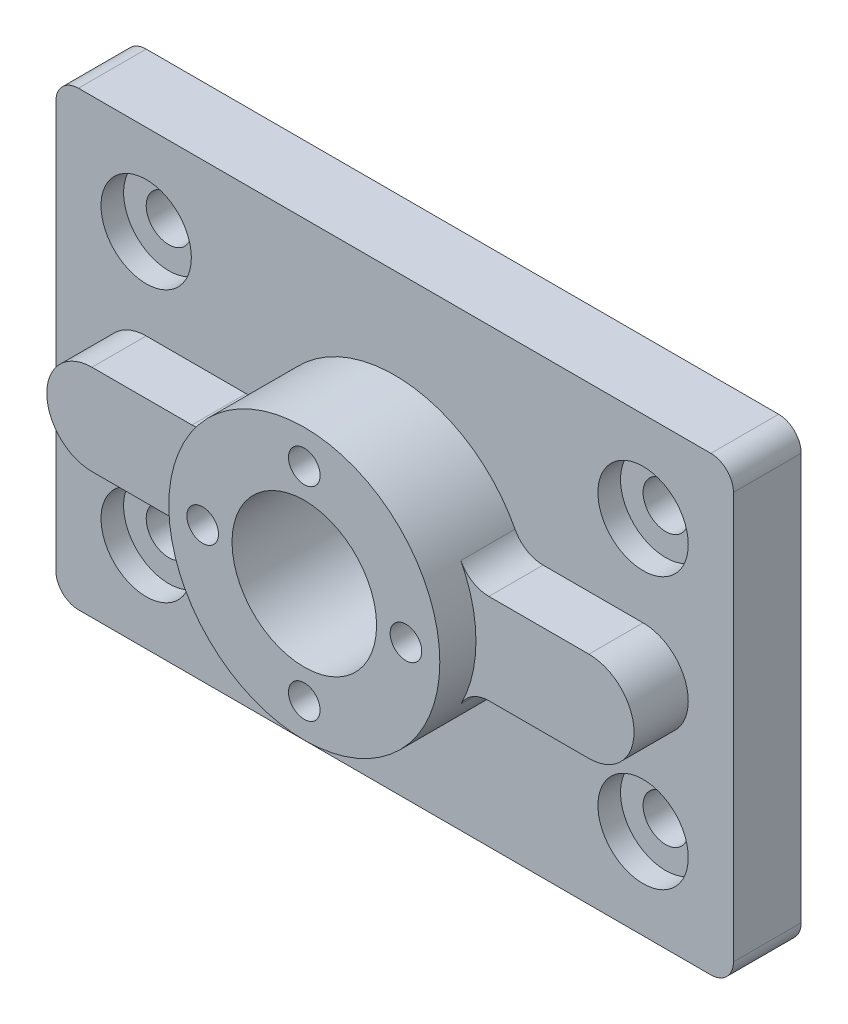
ISO-10303-21;
HEADER;
FILE_DESCRIPTION(('STEP AP214'),'2;1');
FILE_NAME('part.step','',(''),(''),'','','');
FILE_SCHEMA(('AUTOMOTIVE_DESIGN { 1 0 10303 214 1 1 1 1 }'));
ENDSEC;
DATA;
#1=APPLICATION_CONTEXT('core data for automotive mechanical design processes');
#2=APPLICATION_PROTOCOL_DEFINITION('international standard','automotive_design',2000,#1);
#3=PRODUCT_CONTEXT('',#1,'mechanical');
#4=PRODUCT('Part','Part','',(#3));
#5=PRODUCT_RELATED_PRODUCT_CATEGORY('part','',(#4));
#6=PRODUCT_DEFINITION_FORMATION('','',#4);
#7=PRODUCT_DEFINITION_CONTEXT('part definition',#1,'design');
#8=PRODUCT_DEFINITION('design','',#6,#7);
#9=PRODUCT_DEFINITION_SHAPE('','',#8);
#10=(LENGTH_UNIT() NAMED_UNIT(*) SI_UNIT(.MILLI.,.METRE.));
#11=(NAMED_UNIT(*) PLANE_ANGLE_UNIT() SI_UNIT($,.RADIAN.));
#12=(NAMED_UNIT(*) SI_UNIT($,.STERADIAN.) SOLID_ANGLE_UNIT());
#13=UNCERTAINTY_MEASURE_WITH_UNIT(LENGTH_MEASURE(1.E-05),#10,'distance_accuracy_value','');
#14=(GEOMETRIC_REPRESENTATION_CONTEXT(3) GLOBAL_UNCERTAINTY_ASSIGNED_CONTEXT((#13)) GLOBAL_UNIT_ASSIGNED_CONTEXT((#10,
#11,#12)) REPRESENTATION_CONTEXT('',''));
#15=CARTESIAN_POINT('',(0.,0.,0.));
#16=DIRECTION('',(0.,0.,1.));
#17=DIRECTION('',(1.,0.,0.));
#18=AXIS2_PLACEMENT_3D('',#15,#16,#17);
#19=CARTESIAN_POINT('',(5.,5.,15.));
#20=DIRECTION('',(0.,0.,-1.));
#21=DIRECTION('',(-1.,0.,0.));
#22=AXIS2_PLACEMENT_3D('',#19,#20,#21);
#23=PLANE('',#22);
#24=CARTESIAN_POINT('',(20.,20.,15.));
#25=DIRECTION('',(0.,0.,1.));
#26=DIRECTION('',(1.,0.,0.));
#27=AXIS2_PLACEMENT_3D('',#24,#25,#26);
#28=CIRCLE('',#27,10.);
#29=CARTESIAN_POINT('',(30.,20.,15.));
#30=VERTEX_POINT('',#29);
#31=EDGE_CURVE('E677',#30,#30,#28,.T.);
#32=ORIENTED_EDGE('',*,*,#31,.F.);
#33=EDGE_LOOP('',(#32));
#34=FACE_BOUND('',#33,.T.);
#35=CARTESIAN_POINT('',(130.,80.,15.));
#36=DIRECTION('',(0.,0.,1.));
#37=DIRECTION('',(1.,0.,0.));
#38=AXIS2_PLACEMENT_3D('',#35,#36,#37);
#39=CIRCLE('',#38,10.);
#40=CARTESIAN_POINT('',(140.,80.,15.));
#41=VERTEX_POINT('',#40);
#42=EDGE_CURVE('E690',#41,#41,#39,.T.);
#43=ORIENTED_EDGE('',*,*,#42,.F.);
#44=EDGE_LOOP('',(#43));
#45=FACE_BOUND('',#44,.T.);
#46=CARTESIAN_POINT('',(130.,20.,15.));
#47=DIRECTION('',(0.,0.,1.));
#48=DIRECTION('',(1.,0.,0.));
#49=AXIS2_PLACEMENT_3D('',#46,#47,#48);
#50=CIRCLE('',#49,10.);
#51=CARTESIAN_POINT('',(140.,20.,15.));
#52=VERTEX_POINT('',#51);
#53=EDGE_CURVE('E816',#52,#52,#50,.T.);
#54=ORIENTED_EDGE('',*,*,#53,.F.);
#55=EDGE_LOOP('',(#54));
#56=FACE_BOUND('',#55,.T.);
#57=CARTESIAN_POINT('',(20.,80.,15.));
#58=DIRECTION('',(0.,0.,1.));
#59=DIRECTION('',(1.,0.,0.));
#60=AXIS2_PLACEMENT_3D('',#57,#58,#59);
#61=CIRCLE('',#60,10.);
#62=CARTESIAN_POINT('',(30.,80.,15.));
#63=VERTEX_POINT('',#62);
#64=EDGE_CURVE('E704',#63,#63,#61,.T.);
#65=ORIENTED_EDGE('',*,*,#64,.F.);
#66=EDGE_LOOP('',(#65));
#67=FACE_BOUND('',#66,.T.);
#68=CARTESIAN_POINT('',(5.,5.,15.));
#69=DIRECTION('',(0.,0.,1.));
#70=DIRECTION('',(-1.,0.,0.));
#71=AXIS2_PLACEMENT_3D('',#68,#69,#70);
#72=CIRCLE('',#71,5.);
#73=CARTESIAN_POINT('',(0.,5.00000000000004,15.));
#74=VERTEX_POINT('',#73);
#75=CARTESIAN_POINT('',(5.00000000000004,0.,15.));
#76=VERTEX_POINT('',#75);
#77=EDGE_CURVE('E598',#74,#76,#72,.T.);
#78=ORIENTED_EDGE('',*,*,#77,.T.);
#79=DIRECTION('',(1.,0.,0.));
#80=VECTOR('',#79,1.);
#81=CARTESIAN_POINT('',(5.00000000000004,0.,15.));
#82=LINE('',#81,#80);
#83=CARTESIAN_POINT('',(145.,0.,15.));
#84=VERTEX_POINT('',#83);
#85=EDGE_CURVE('E661',#76,#84,#82,.T.);
#86=ORIENTED_EDGE('',*,*,#85,.T.);
#87=CARTESIAN_POINT('',(145.,5.,15.));
#88=DIRECTION('',(0.,0.,1.));
#89=DIRECTION('',(1.,0.,0.));
#90=AXIS2_PLACEMENT_3D('',#87,#88,#89);
#91=CIRCLE('',#90,5.);
#92=CARTESIAN_POINT('',(150.,5.,15.));
#93=VERTEX_POINT('',#92);
#94=EDGE_CURVE('E665',#84,#93,#91,.T.);
#95=ORIENTED_EDGE('',*,*,#94,.T.);
#96=DIRECTION('',(0.,1.,0.));
#97=VECTOR('',#96,1.);
#98=CARTESIAN_POINT('',(150.,5.00000000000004,15.));
#99=LINE('',#98,#97);
#100=CARTESIAN_POINT('',(150.,95.,15.));
#101=VERTEX_POINT('',#100);
#102=EDGE_CURVE('E718',#93,#101,#99,.T.);
#103=ORIENTED_EDGE('',*,*,#102,.T.);
#104=CARTESIAN_POINT('',(145.,95.,15.));
#105=DIRECTION('',(0.,0.,1.));
#106=DIRECTION('',(-1.,0.,0.));
#107=AXIS2_PLACEMENT_3D('',#104,#105,#106);
#108=CIRCLE('',#107,5.);
#109=CARTESIAN_POINT('',(145.,100.,15.));
#110=VERTEX_POINT('',#109);
#111=EDGE_CURVE('E722',#101,#110,#108,.T.);
#112=ORIENTED_EDGE('',*,*,#111,.T.);
#113=DIRECTION('',(-1.,0.,0.));
#114=VECTOR('',#113,1.);
#115=CARTESIAN_POINT('',(5.00000000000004,100.,15.));
#116=LINE('',#115,#114);
#117=CARTESIAN_POINT('',(5.00000000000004,100.,15.));
#118=VERTEX_POINT('',#117);
#119=EDGE_CURVE('E726',#110,#118,#116,.T.);
#120=ORIENTED_EDGE('',*,*,#119,.T.);
#121=CARTESIAN_POINT('',(5.,95.,15.));
#122=DIRECTION('',(0.,0.,1.));
#123=DIRECTION('',(-1.,0.,0.));
#124=AXIS2_PLACEMENT_3D('',#121,#122,#123);
#125=CIRCLE('',#124,5.);
#126=CARTESIAN_POINT('',(0.,95.,15.));
#127=VERTEX_POINT('',#126);
#128=EDGE_CURVE('E731',#118,#127,#125,.T.);
#129=ORIENTED_EDGE('',*,*,#128,.T.);
#130=DIRECTION('',(0.,-1.,0.));
#131=VECTOR('',#130,1.);
#132=CARTESIAN_POINT('',(0.,5.00000000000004,15.));
#133=LINE('',#132,#131);
#134=EDGE_CURVE('E567',#127,#74,#133,.T.);
#135=ORIENTED_EDGE('',*,*,#134,.T.);
#136=EDGE_LOOP('',(#78,#86,#95,#103,#112,#120,#129,#135));
#137=FACE_BOUND('',#136,.T.);
#138=CARTESIAN_POINT('',(75.,50.,15.));
#139=DIRECTION('',(0.,0.,1.));
#140=DIRECTION('',(1.,0.,0.));
#141=AXIS2_PLACEMENT_3D('',#138,#139,#140);
#142=CIRCLE('',#141,30.);
#143=CARTESIAN_POINT('',(101.645962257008,63.7837837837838,15.));
#144=VERTEX_POINT('',#143);
#145=CARTESIAN_POINT('',(48.3540377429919,63.7837837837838,15.));
#146=VERTEX_POINT('',#145);
#147=EDGE_CURVE('E668',#144,#146,#142,.T.);
#148=ORIENTED_EDGE('',*,*,#147,.F.);
#149=CARTESIAN_POINT('',(107.86335345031,67.,15.));
#150=DIRECTION('',(0.,0.,-1.));
#151=DIRECTION('',(-1.,0.,0.));
#152=AXIS2_PLACEMENT_3D('',#149,#150,#151);
#153=CIRCLE('',#152,7.);
#154=CARTESIAN_POINT('',(107.86335345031,60.,15.));
#155=VERTEX_POINT('',#154);
#156=EDGE_CURVE('E948',#144,#155,#153,.F.);
#157=ORIENTED_EDGE('',*,*,#156,.T.);
#158=DIRECTION('',(-1.,0.,0.));
#159=VECTOR('',#158,1.);
#160=CARTESIAN_POINT('',(130.,60.,15.));
#161=LINE('',#160,#159);
#162=CARTESIAN_POINT('',(130.,60.,15.));
#163=VERTEX_POINT('',#162);
#164=EDGE_CURVE('E270',#163,#155,#161,.T.);
#165=ORIENTED_EDGE('',*,*,#164,.F.);
#166=CARTESIAN_POINT('',(130.,50.,15.));
#167=DIRECTION('',(0.,0.,1.));
#168=DIRECTION('',(-1.,0.,0.));
#169=AXIS2_PLACEMENT_3D('',#166,#167,#168);
#170=CIRCLE('',#169,10.);
#171=CARTESIAN_POINT('',(130.,40.,15.));
#172=VERTEX_POINT('',#171);
#173=EDGE_CURVE('E264',#172,#163,#170,.T.);
#174=ORIENTED_EDGE('',*,*,#173,.F.);
#175=DIRECTION('',(1.,0.,0.));
#176=VECTOR('',#175,1.);
#177=CARTESIAN_POINT('',(130.,40.,15.));
#178=LINE('',#177,#176);
#179=CARTESIAN_POINT('',(107.86335345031,40.,15.));
#180=VERTEX_POINT('',#179);
#181=EDGE_CURVE('E1051',#180,#172,#178,.T.);
#182=ORIENTED_EDGE('',*,*,#181,.F.);
#183=CARTESIAN_POINT('',(107.86335345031,33.,15.));
#184=DIRECTION('',(0.,0.,-1.));
#185=DIRECTION('',(-1.,0.,0.));
#186=AXIS2_PLACEMENT_3D('',#183,#184,#185);
#187=CIRCLE('',#186,7.);
#188=CARTESIAN_POINT('',(101.645962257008,36.2162162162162,15.));
#189=VERTEX_POINT('',#188);
#190=EDGE_CURVE('E956',#180,#189,#187,.F.);
#191=ORIENTED_EDGE('',*,*,#190,.T.);
#192=CARTESIAN_POINT('',(48.3540377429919,36.2162162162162,15.));
#193=VERTEX_POINT('',#192);
#194=EDGE_CURVE('E978',#193,#189,#142,.T.);
#195=ORIENTED_EDGE('',*,*,#194,.F.);
#196=CARTESIAN_POINT('',(42.13664654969,33.,15.));
#197=DIRECTION('',(0.,0.,-1.));
#198=DIRECTION('',(-1.,0.,0.));
#199=AXIS2_PLACEMENT_3D('',#196,#197,#198);
#200=CIRCLE('',#199,7.);
#201=CARTESIAN_POINT('',(42.13664654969,40.,15.));
#202=VERTEX_POINT('',#201);
#203=EDGE_CURVE('E953',#193,#202,#200,.F.);
#204=ORIENTED_EDGE('',*,*,#203,.T.);
#205=DIRECTION('',(1.,0.,0.));
#206=VECTOR('',#205,1.);
#207=CARTESIAN_POINT('',(20.,40.,15.));
#208=LINE('',#207,#206);
#209=CARTESIAN_POINT('',(20.,40.,15.));
#210=VERTEX_POINT('',#209);
#211=EDGE_CURVE('E1030',#210,#202,#208,.T.);
#212=ORIENTED_EDGE('',*,*,#211,.F.);
#213=CARTESIAN_POINT('',(20.,50.,15.));
#214=DIRECTION('',(0.,0.,1.));
#215=DIRECTION('',(1.,0.,0.));
#216=AXIS2_PLACEMENT_3D('',#213,#214,#215);
#217=CIRCLE('',#216,10.);
#218=CARTESIAN_POINT('',(20.,60.,15.));
#219=VERTEX_POINT('',#218);
#220=EDGE_CURVE('E261',#219,#210,#217,.T.);
#221=ORIENTED_EDGE('',*,*,#220,.F.);
#222=DIRECTION('',(-1.,0.,0.));
#223=VECTOR('',#222,1.);
#224=CARTESIAN_POINT('',(20.,60.,15.));
#225=LINE('',#224,#223);
#226=CARTESIAN_POINT('',(42.13664654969,60.,15.));
#227=VERTEX_POINT('',#226);
#228=EDGE_CURVE('E257',#227,#219,#225,.T.);
#229=ORIENTED_EDGE('',*,*,#228,.F.);
#230=CARTESIAN_POINT('',(42.13664654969,67.,15.));
#231=DIRECTION('',(0.,0.,-1.));
#232=DIRECTION('',(-1.,0.,0.));
#233=AXIS2_PLACEMENT_3D('',#230,#231,#232);
#234=CIRCLE('',#233,7.);
#235=EDGE_CURVE('E950',#227,#146,#234,.F.);
#236=ORIENTED_EDGE('',*,*,#235,.T.);
#237=EDGE_LOOP('',(#148,#157,#165,#174,#182,#191,#195,#204,#212,#221,#229,#236));
#238=FACE_BOUND('',#237,.T.);
#239=ADVANCED_FACE('F53',(#34,#45,#56,#67,#137,#238),#23,.F.);
#240=CARTESIAN_POINT('',(75.,50.,35.));
#241=DIRECTION('',(0.,0.,-1.));
#242=DIRECTION('',(-1.,0.,0.));
#243=AXIS2_PLACEMENT_3D('',#240,#241,#242);
#244=CYLINDRICAL_SURFACE('',#243,30.);
#245=CARTESIAN_POINT('',(75.,50.,35.));
#246=DIRECTION('',(0.,0.,1.));
#247=DIRECTION('',(1.,0.,0.));
#248=AXIS2_PLACEMENT_3D('',#245,#246,#247);
#249=CIRCLE('',#248,30.);
#250=CARTESIAN_POINT('',(105.,50.,35.));
#251=VERTEX_POINT('',#250);
#252=EDGE_CURVE('E526',#251,#251,#249,.T.);
#253=ORIENTED_EDGE('',*,*,#252,.F.);
#254=EDGE_LOOP('',(#253));
#255=FACE_BOUND('',#254,.T.);
#256=CARTESIAN_POINT('',(75.,50.,27.));
#257=DIRECTION('',(0.,0.,-1.));
#258=DIRECTION('',(1.,0.,0.));
#259=AXIS2_PLACEMENT_3D('',#256,#257,#258);
#260=CIRCLE('',#259,30.);
#261=CARTESIAN_POINT('',(101.645962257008,63.7837837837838,27.));
#262=VERTEX_POINT('',#261);
#263=CARTESIAN_POINT('',(101.645962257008,36.2162162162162,27.));
#264=VERTEX_POINT('',#263);
#265=EDGE_CURVE('E312',#262,#264,#260,.T.);
#266=ORIENTED_EDGE('',*,*,#265,.F.);
#267=DIRECTION('',(0.,0.,-1.));
#268=VECTOR('',#267,1.);
#269=CARTESIAN_POINT('',(101.645962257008,63.7837837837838,35.));
#270=LINE('',#269,#268);
#271=EDGE_CURVE('E959',#262,#144,#270,.T.);
#272=ORIENTED_EDGE('',*,*,#271,.T.);
#273=ORIENTED_EDGE('',*,*,#147,.T.);
#274=DIRECTION('',(0.,0.,-1.));
#275=VECTOR('',#274,1.);
#276=CARTESIAN_POINT('',(48.3540377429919,63.7837837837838,35.));
#277=LINE('',#276,#275);
#278=CARTESIAN_POINT('',(48.3540377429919,63.7837837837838,27.));
#279=VERTEX_POINT('',#278);
#280=EDGE_CURVE('E963',#146,#279,#277,.F.);
#281=ORIENTED_EDGE('',*,*,#280,.T.);
#282=CARTESIAN_POINT('',(75.,50.,27.));
#283=DIRECTION('',(0.,0.,-1.));
#284=DIRECTION('',(1.,0.,0.));
#285=AXIS2_PLACEMENT_3D('',#282,#283,#284);
#286=CIRCLE('',#285,30.);
#287=CARTESIAN_POINT('',(48.3540377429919,36.2162162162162,27.));
#288=VERTEX_POINT('',#287);
#289=EDGE_CURVE('E246',#288,#279,#286,.T.);
#290=ORIENTED_EDGE('',*,*,#289,.F.);
#291=DIRECTION('',(0.,0.,-1.));
#292=VECTOR('',#291,1.);
#293=CARTESIAN_POINT('',(48.3540377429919,36.2162162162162,35.));
#294=LINE('',#293,#292);
#295=EDGE_CURVE('E967',#288,#193,#294,.T.);
#296=ORIENTED_EDGE('',*,*,#295,.T.);
#297=ORIENTED_EDGE('',*,*,#194,.T.);
#298=DIRECTION('',(0.,0.,-1.));
#299=VECTOR('',#298,1.);
#300=CARTESIAN_POINT('',(101.645962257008,36.2162162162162,35.));
#301=LINE('',#300,#299);
#302=EDGE_CURVE('E971',#189,#264,#301,.F.);
#303=ORIENTED_EDGE('',*,*,#302,.T.);
#304=EDGE_LOOP('',(#266,#272,#273,#281,#290,#296,#297,#303));
#305=FACE_BOUND('',#304,.T.);
#306=ADVANCED_FACE('F756',(#255,#305),#244,.T.);
#307=CARTESIAN_POINT('',(20.,20.,25.));
#308=DIRECTION('',(0.,0.,-1.));
#309=DIRECTION('',(-1.,0.,0.));
#310=AXIS2_PLACEMENT_3D('',#307,#308,#309);
#311=CYLINDRICAL_SURFACE('',#310,5.);
#312=CARTESIAN_POINT('',(20.,20.,0.));
#313=DIRECTION('',(0.,0.,-1.));
#314=DIRECTION('',(-1.,0.,0.));
#315=AXIS2_PLACEMENT_3D('',#312,#313,#314);
#316=CIRCLE('',#315,5.);
#317=CARTESIAN_POINT('',(15.,20.,0.));
#318=VERTEX_POINT('',#317);
#319=EDGE_CURVE('E341',#318,#318,#316,.T.);
#320=ORIENTED_EDGE('',*,*,#319,.T.);
#321=EDGE_LOOP('',(#320));
#322=FACE_BOUND('',#321,.T.);
#323=CARTESIAN_POINT('',(20.,20.,10.));
#324=DIRECTION('',(0.,0.,1.));
#325=DIRECTION('',(1.,0.,0.));
#326=AXIS2_PLACEMENT_3D('',#323,#324,#325);
#327=CIRCLE('',#326,5.);
#328=CARTESIAN_POINT('',(25.,20.,10.));
#329=VERTEX_POINT('',#328);
#330=EDGE_CURVE('E799',#329,#329,#327,.F.);
#331=ORIENTED_EDGE('',*,*,#330,.F.);
#332=EDGE_LOOP('',(#331));
#333=FACE_BOUND('',#332,.T.);
#334=ADVANCED_FACE('F762',(#322,#333),#311,.F.);
#335=CARTESIAN_POINT('',(20.,80.,25.));
#336=DIRECTION('',(0.,0.,-1.));
#337=DIRECTION('',(-1.,0.,0.));
#338=AXIS2_PLACEMENT_3D('',#335,#336,#337);
#339=CYLINDRICAL_SURFACE('',#338,5.);
#340=CARTESIAN_POINT('',(20.,80.,0.));
#341=DIRECTION('',(0.,0.,-1.));
#342=DIRECTION('',(-1.,0.,0.));
#343=AXIS2_PLACEMENT_3D('',#340,#341,#342);
#344=CIRCLE('',#343,5.);
#345=CARTESIAN_POINT('',(15.,80.,0.));
#346=VERTEX_POINT('',#345);
#347=EDGE_CURVE('E348',#346,#346,#344,.T.);
#348=ORIENTED_EDGE('',*,*,#347,.T.);
#349=EDGE_LOOP('',(#348));
#350=FACE_BOUND('',#349,.T.);
#351=CARTESIAN_POINT('',(20.,80.,10.));
#352=DIRECTION('',(0.,0.,1.));
#353=DIRECTION('',(1.,0.,0.));
#354=AXIS2_PLACEMENT_3D('',#351,#352,#353);
#355=CIRCLE('',#354,5.);
#356=CARTESIAN_POINT('',(25.,80.,10.));
#357=VERTEX_POINT('',#356);
#358=EDGE_CURVE('E802',#357,#357,#355,.F.);
#359=ORIENTED_EDGE('',*,*,#358,.F.);
#360=EDGE_LOOP('',(#359));
#361=FACE_BOUND('',#360,.T.);
#362=ADVANCED_FACE('F795',(#350,#361),#339,.F.);
#363=CARTESIAN_POINT('',(130.,80.,25.));
#364=DIRECTION('',(0.,0.,-1.));
#365=DIRECTION('',(-1.,0.,0.));
#366=AXIS2_PLACEMENT_3D('',#363,#364,#365);
#367=CYLINDRICAL_SURFACE('',#366,4.99999999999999);
#368=CARTESIAN_POINT('',(130.,80.,0.));
#369=DIRECTION('',(0.,0.,-1.));
#370=DIRECTION('',(-1.,0.,0.));
#371=AXIS2_PLACEMENT_3D('',#368,#369,#370);
#372=CIRCLE('',#371,4.99999999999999);
#373=CARTESIAN_POINT('',(125.,80.,0.));
#374=VERTEX_POINT('',#373);
#375=EDGE_CURVE('E787',#374,#374,#372,.T.);
#376=ORIENTED_EDGE('',*,*,#375,.T.);
#377=EDGE_LOOP('',(#376));
#378=FACE_BOUND('',#377,.T.);
#379=CARTESIAN_POINT('',(130.,80.,10.));
#380=DIRECTION('',(0.,0.,1.));
#381=DIRECTION('',(1.,0.,0.));
#382=AXIS2_PLACEMENT_3D('',#379,#380,#381);
#383=CIRCLE('',#382,4.99999999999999);
#384=CARTESIAN_POINT('',(135.,80.,10.));
#385=VERTEX_POINT('',#384);
#386=EDGE_CURVE('E808',#385,#385,#383,.F.);
#387=ORIENTED_EDGE('',*,*,#386,.F.);
#388=EDGE_LOOP('',(#387));
#389=FACE_BOUND('',#388,.T.);
#390=ADVANCED_FACE('F868',(#378,#389),#367,.F.);
#391=CARTESIAN_POINT('',(130.,20.,25.));
#392=DIRECTION('',(0.,0.,-1.));
#393=DIRECTION('',(-1.,0.,0.));
#394=AXIS2_PLACEMENT_3D('',#391,#392,#393);
#395=CYLINDRICAL_SURFACE('',#394,4.99999999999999);
#396=CARTESIAN_POINT('',(130.,20.,0.));
#397=DIRECTION('',(0.,0.,-1.));
#398=DIRECTION('',(-1.,0.,0.));
#399=AXIS2_PLACEMENT_3D('',#396,#397,#398);
#400=CIRCLE('',#399,4.99999999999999);
#401=CARTESIAN_POINT('',(125.,20.,0.));
#402=VERTEX_POINT('',#401);
#403=EDGE_CURVE('E349',#402,#402,#400,.T.);
#404=ORIENTED_EDGE('',*,*,#403,.T.);
#405=EDGE_LOOP('',(#404));
#406=FACE_BOUND('',#405,.T.);
#407=CARTESIAN_POINT('',(130.,20.,10.));
#408=DIRECTION('',(0.,0.,1.));
#409=DIRECTION('',(1.,0.,0.));
#410=AXIS2_PLACEMENT_3D('',#407,#408,#409);
#411=CIRCLE('',#410,4.99999999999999);
#412=CARTESIAN_POINT('',(135.,20.,10.));
#413=VERTEX_POINT('',#412);
#414=EDGE_CURVE('E548',#413,#413,#411,.F.);
#415=ORIENTED_EDGE('',*,*,#414,.F.);
#416=EDGE_LOOP('',(#415));
#417=FACE_BOUND('',#416,.T.);
#418=ADVANCED_FACE('F778',(#406,#417),#395,.F.);
#419=CARTESIAN_POINT('',(75.,50.,15.));
#420=DIRECTION('',(0.,0.,-1.));
#421=DIRECTION('',(-1.,0.,0.));
#422=AXIS2_PLACEMENT_3D('',#419,#420,#421);
#423=CYLINDRICAL_SURFACE('',#422,16.);
#424=CARTESIAN_POINT('',(75.,50.,35.));
#425=DIRECTION('',(0.,0.,1.));
#426=DIRECTION('',(1.,0.,0.));
#427=AXIS2_PLACEMENT_3D('',#424,#425,#426);
#428=CIRCLE('',#427,16.);
#429=CARTESIAN_POINT('',(91.,50.,35.));
#430=VERTEX_POINT('',#429);
#431=EDGE_CURVE('E521',#430,#430,#428,.T.);
#432=ORIENTED_EDGE('',*,*,#431,.T.);
#433=EDGE_LOOP('',(#432));
#434=FACE_BOUND('',#433,.T.);
#435=CARTESIAN_POINT('',(75.,50.,12.));
#436=DIRECTION('',(0.,0.,-1.));
#437=DIRECTION('',(-1.,0.,0.));
#438=AXIS2_PLACEMENT_3D('',#435,#436,#437);
#439=CIRCLE('',#438,16.);
#440=CARTESIAN_POINT('',(59.,50.,12.));
#441=VERTEX_POINT('',#440);
#442=EDGE_CURVE('E375',#441,#441,#439,.T.);
#443=ORIENTED_EDGE('',*,*,#442,.T.);
#444=EDGE_LOOP('',(#443));
#445=FACE_BOUND('',#444,.T.);
#446=ADVANCED_FACE('F769',(#434,#445),#423,.F.);
#447=CARTESIAN_POINT('',(5.,5.,0.));
#448=DIRECTION('',(0.,0.,-1.));
#449=DIRECTION('',(-1.,0.,0.));
#450=AXIS2_PLACEMENT_3D('',#447,#448,#449);
#451=PLANE('',#450);
#452=ORIENTED_EDGE('',*,*,#403,.F.);
#453=EDGE_LOOP('',(#452));
#454=FACE_BOUND('',#453,.T.);
#455=ORIENTED_EDGE('',*,*,#375,.F.);
#456=EDGE_LOOP('',(#455));
#457=FACE_BOUND('',#456,.T.);
#458=ORIENTED_EDGE('',*,*,#347,.F.);
#459=EDGE_LOOP('',(#458));
#460=FACE_BOUND('',#459,.T.);
#461=ORIENTED_EDGE('',*,*,#319,.F.);
#462=EDGE_LOOP('',(#461));
#463=FACE_BOUND('',#462,.T.);
#464=CARTESIAN_POINT('',(45.,20.,0.));
#465=DIRECTION('',(0.,0.,-1.));
#466=DIRECTION('',(-1.,0.,0.));
#467=AXIS2_PLACEMENT_3D('',#464,#465,#466);
#468=CIRCLE('',#467,5.);
#469=CARTESIAN_POINT('',(45.,15.,0.));
#470=VERTEX_POINT('',#469);
#471=CARTESIAN_POINT('',(40.,20.,0.));
#472=VERTEX_POINT('',#471);
#473=EDGE_CURVE('E347',#470,#472,#468,.T.);
#474=ORIENTED_EDGE('',*,*,#473,.F.);
#475=DIRECTION('',(1.,0.,0.));
#476=VECTOR('',#475,1.);
#477=CARTESIAN_POINT('',(45.,15.,0.));
#478=LINE('',#477,#476);
#479=CARTESIAN_POINT('',(105.,15.,0.));
#480=VERTEX_POINT('',#479);
#481=EDGE_CURVE('E358',#470,#480,#478,.T.);
#482=ORIENTED_EDGE('',*,*,#481,.T.);
#483=CARTESIAN_POINT('',(105.,20.,0.));
#484=DIRECTION('',(0.,0.,1.));
#485=DIRECTION('',(1.,0.,0.));
#486=AXIS2_PLACEMENT_3D('',#483,#484,#485);
#487=CIRCLE('',#486,5.);
#488=CARTESIAN_POINT('',(110.,20.,0.));
#489=VERTEX_POINT('',#488);
#490=EDGE_CURVE('E416',#480,#489,#487,.T.);
#491=ORIENTED_EDGE('',*,*,#490,.T.);
#492=DIRECTION('',(0.,1.,0.));
#493=VECTOR('',#492,1.);
#494=CARTESIAN_POINT('',(110.,20.,0.));
#495=LINE('',#494,#493);
#496=CARTESIAN_POINT('',(110.,80.,0.));
#497=VERTEX_POINT('',#496);
#498=EDGE_CURVE('E420',#489,#497,#495,.T.);
#499=ORIENTED_EDGE('',*,*,#498,.T.);
#500=CARTESIAN_POINT('',(105.,80.,0.));
#501=DIRECTION('',(0.,0.,-1.));
#502=DIRECTION('',(-1.,0.,0.));
#503=AXIS2_PLACEMENT_3D('',#500,#501,#502);
#504=CIRCLE('',#503,5.00000000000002);
#505=CARTESIAN_POINT('',(105.,85.,0.));
#506=VERTEX_POINT('',#505);
#507=EDGE_CURVE('E425',#506,#497,#504,.T.);
#508=ORIENTED_EDGE('',*,*,#507,.F.);
#509=DIRECTION('',(1.,0.,0.));
#510=VECTOR('',#509,1.);
#511=CARTESIAN_POINT('',(45.,85.,0.));
#512=LINE('',#511,#510);
#513=CARTESIAN_POINT('',(45.,85.,0.));
#514=VERTEX_POINT('',#513);
#515=EDGE_CURVE('E430',#514,#506,#512,.T.);
#516=ORIENTED_EDGE('',*,*,#515,.F.);
#517=CARTESIAN_POINT('',(45.,80.,0.));
#518=DIRECTION('',(0.,0.,-1.));
#519=DIRECTION('',(-1.,0.,0.));
#520=AXIS2_PLACEMENT_3D('',#517,#518,#519);
#521=CIRCLE('',#520,5.);
#522=CARTESIAN_POINT('',(40.,80.,0.));
#523=VERTEX_POINT('',#522);
#524=EDGE_CURVE('E436',#523,#514,#521,.T.);
#525=ORIENTED_EDGE('',*,*,#524,.F.);
#526=DIRECTION('',(0.,1.,0.));
#527=VECTOR('',#526,1.);
#528=CARTESIAN_POINT('',(40.,20.,0.));
#529=LINE('',#528,#527);
#530=EDGE_CURVE('E404',#472,#523,#529,.T.);
#531=ORIENTED_EDGE('',*,*,#530,.F.);
#532=EDGE_LOOP('',(#474,#482,#491,#499,#508,#516,#525,#531));
#533=FACE_BOUND('',#532,.T.);
#534=CARTESIAN_POINT('',(5.,5.,0.));
#535=DIRECTION('',(0.,0.,1.));
#536=DIRECTION('',(-1.,0.,0.));
#537=AXIS2_PLACEMENT_3D('',#534,#535,#536);
#538=CIRCLE('',#537,5.);
#539=CARTESIAN_POINT('',(0.,5.00000000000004,0.));
#540=VERTEX_POINT('',#539);
#541=CARTESIAN_POINT('',(5.00000000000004,0.,0.));
#542=VERTEX_POINT('',#541);
#543=EDGE_CURVE('E561',#540,#542,#538,.T.);
#544=ORIENTED_EDGE('',*,*,#543,.F.);
#545=DIRECTION('',(0.,-1.,0.));
#546=VECTOR('',#545,1.);
#547=CARTESIAN_POINT('',(0.,5.00000000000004,0.));
#548=LINE('',#547,#546);
#549=CARTESIAN_POINT('',(0.,95.,0.));
#550=VERTEX_POINT('',#549);
#551=EDGE_CURVE('E594',#550,#540,#548,.T.);
#552=ORIENTED_EDGE('',*,*,#551,.F.);
#553=CARTESIAN_POINT('',(5.,95.,0.));
#554=DIRECTION('',(0.,0.,1.));
#555=DIRECTION('',(-1.,0.,0.));
#556=AXIS2_PLACEMENT_3D('',#553,#554,#555);
#557=CIRCLE('',#556,5.);
#558=CARTESIAN_POINT('',(5.00000000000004,100.,0.));
#559=VERTEX_POINT('',#558);
#560=EDGE_CURVE('E591',#559,#550,#557,.T.);
#561=ORIENTED_EDGE('',*,*,#560,.F.);
#562=DIRECTION('',(-1.,0.,0.));
#563=VECTOR('',#562,1.);
#564=CARTESIAN_POINT('',(5.00000000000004,100.,0.));
#565=LINE('',#564,#563);
#566=CARTESIAN_POINT('',(145.,100.,0.));
#567=VERTEX_POINT('',#566);
#568=EDGE_CURVE('E587',#567,#559,#565,.T.);
#569=ORIENTED_EDGE('',*,*,#568,.F.);
#570=CARTESIAN_POINT('',(145.,95.,0.));
#571=DIRECTION('',(0.,0.,1.));
#572=DIRECTION('',(-1.,0.,0.));
#573=AXIS2_PLACEMENT_3D('',#570,#571,#572);
#574=CIRCLE('',#573,5.);
#575=CARTESIAN_POINT('',(150.,95.,0.));
#576=VERTEX_POINT('',#575);
#577=EDGE_CURVE('E584',#576,#567,#574,.T.);
#578=ORIENTED_EDGE('',*,*,#577,.F.);
#579=DIRECTION('',(0.,1.,0.));
#580=VECTOR('',#579,1.);
#581=CARTESIAN_POINT('',(150.,5.00000000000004,0.));
#582=LINE('',#581,#580);
#583=CARTESIAN_POINT('',(150.,5.,0.));
#584=VERTEX_POINT('',#583);
#585=EDGE_CURVE('E577',#584,#576,#582,.T.);
#586=ORIENTED_EDGE('',*,*,#585,.F.);
#587=CARTESIAN_POINT('',(145.,5.,0.));
#588=DIRECTION('',(0.,0.,1.));
#589=DIRECTION('',(1.,0.,0.));
#590=AXIS2_PLACEMENT_3D('',#587,#588,#589);
#591=CIRCLE('',#590,5.);
#592=CARTESIAN_POINT('',(145.,0.,0.));
#593=VERTEX_POINT('',#592);
#594=EDGE_CURVE('E573',#593,#584,#591,.T.);
#595=ORIENTED_EDGE('',*,*,#594,.F.);
#596=DIRECTION('',(1.,0.,0.));
#597=VECTOR('',#596,1.);
#598=CARTESIAN_POINT('',(5.00000000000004,0.,0.));
#599=LINE('',#598,#597);
#600=EDGE_CURVE('E566',#542,#593,#599,.T.);
#601=ORIENTED_EDGE('',*,*,#600,.F.);
#602=EDGE_LOOP('',(#544,#552,#561,#569,#578,#586,#595,#601));
#603=FACE_BOUND('',#602,.T.);
#604=ADVANCED_FACE('F457',(#454,#457,#460,#463,#533,#603),#451,.T.);
#605=CARTESIAN_POINT('',(5.,5.,15.));
#606=DIRECTION('',(0.,0.,-1.));
#607=DIRECTION('',(-1.,0.,0.));
#608=AXIS2_PLACEMENT_3D('',#605,#606,#607);
#609=CYLINDRICAL_SURFACE('',#608,5.);
#610=ORIENTED_EDGE('',*,*,#543,.T.);
#611=DIRECTION('',(0.,0.,-1.));
#612=VECTOR('',#611,1.);
#613=CARTESIAN_POINT('',(5.00000000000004,0.,15.));
#614=LINE('',#613,#612);
#615=EDGE_CURVE('E545',#76,#542,#614,.T.);
#616=ORIENTED_EDGE('',*,*,#615,.F.);
#617=ORIENTED_EDGE('',*,*,#77,.F.);
#618=DIRECTION('',(0.,0.,-1.));
#619=VECTOR('',#618,1.);
#620=CARTESIAN_POINT('',(0.,5.00000000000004,15.));
#621=LINE('',#620,#619);
#622=EDGE_CURVE('E599',#74,#540,#621,.T.);
#623=ORIENTED_EDGE('',*,*,#622,.T.);
#624=EDGE_LOOP('',(#610,#616,#617,#623));
#625=FACE_BOUND('',#624,.T.);
#626=ADVANCED_FACE('F656',(#625),#609,.T.);
#627=CARTESIAN_POINT('',(5.00000000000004,0.,15.));
#628=DIRECTION('',(0.,1.,0.));
#629=DIRECTION('',(0.,0.,1.));
#630=AXIS2_PLACEMENT_3D('',#627,#628,#629);
#631=PLANE('',#630);
#632=ORIENTED_EDGE('',*,*,#600,.T.);
#633=DIRECTION('',(0.,0.,-1.));
#634=VECTOR('',#633,1.);
#635=CARTESIAN_POINT('',(145.,0.,15.));
#636=LINE('',#635,#634);
#637=EDGE_CURVE('E614',#84,#593,#636,.T.);
#638=ORIENTED_EDGE('',*,*,#637,.F.);
#639=ORIENTED_EDGE('',*,*,#85,.F.);
#640=ORIENTED_EDGE('',*,*,#615,.T.);
#641=EDGE_LOOP('',(#632,#638,#639,#640));
#642=FACE_BOUND('',#641,.T.);
#643=ADVANCED_FACE('F776',(#642),#631,.F.);
#644=CARTESIAN_POINT('',(145.,5.,15.));
#645=DIRECTION('',(0.,0.,-1.));
#646=DIRECTION('',(-1.,0.,0.));
#647=AXIS2_PLACEMENT_3D('',#644,#645,#646);
#648=CYLINDRICAL_SURFACE('',#647,5.);
#649=ORIENTED_EDGE('',*,*,#594,.T.);
#650=DIRECTION('',(0.,0.,-1.));
#651=VECTOR('',#650,1.);
#652=CARTESIAN_POINT('',(150.,5.,15.));
#653=LINE('',#652,#651);
#654=EDGE_CURVE('E618',#93,#584,#653,.T.);
#655=ORIENTED_EDGE('',*,*,#654,.F.);
#656=ORIENTED_EDGE('',*,*,#94,.F.);
#657=ORIENTED_EDGE('',*,*,#637,.T.);
#658=EDGE_LOOP('',(#649,#655,#656,#657));
#659=FACE_BOUND('',#658,.T.);
#660=ADVANCED_FACE('F988',(#659),#648,.T.);
#661=CARTESIAN_POINT('',(150.,5.00000000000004,15.));
#662=DIRECTION('',(-1.,0.,0.));
#663=DIRECTION('',(0.,0.,1.));
#664=AXIS2_PLACEMENT_3D('',#661,#662,#663);
#665=PLANE('',#664);
#666=ORIENTED_EDGE('',*,*,#585,.T.);
#667=DIRECTION('',(0.,0.,-1.));
#668=VECTOR('',#667,1.);
#669=CARTESIAN_POINT('',(150.,95.,15.));
#670=LINE('',#669,#668);
#671=EDGE_CURVE('E623',#101,#576,#670,.T.);
#672=ORIENTED_EDGE('',*,*,#671,.F.);
#673=ORIENTED_EDGE('',*,*,#102,.F.);
#674=ORIENTED_EDGE('',*,*,#654,.T.);
#675=EDGE_LOOP('',(#666,#672,#673,#674));
#676=FACE_BOUND('',#675,.T.);
#677=ADVANCED_FACE('F991',(#676),#665,.F.);
#678=CARTESIAN_POINT('',(145.,95.,15.));
#679=DIRECTION('',(0.,0.,-1.));
#680=DIRECTION('',(-1.,0.,0.));
#681=AXIS2_PLACEMENT_3D('',#678,#679,#680);
#682=CYLINDRICAL_SURFACE('',#681,5.);
#683=ORIENTED_EDGE('',*,*,#577,.T.);
#684=DIRECTION('',(0.,0.,-1.));
#685=VECTOR('',#684,1.);
#686=CARTESIAN_POINT('',(145.,100.,15.));
#687=LINE('',#686,#685);
#688=EDGE_CURVE('E628',#110,#567,#687,.T.);
#689=ORIENTED_EDGE('',*,*,#688,.F.);
#690=ORIENTED_EDGE('',*,*,#111,.F.);
#691=ORIENTED_EDGE('',*,*,#671,.T.);
#692=EDGE_LOOP('',(#683,#689,#690,#691));
#693=FACE_BOUND('',#692,.T.);
#694=ADVANCED_FACE('F753',(#693),#682,.T.);
#695=CARTESIAN_POINT('',(5.00000000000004,100.,15.));
#696=DIRECTION('',(0.,-1.,0.));
#697=DIRECTION('',(0.,0.,-1.));
#698=AXIS2_PLACEMENT_3D('',#695,#696,#697);
#699=PLANE('',#698);
#700=ORIENTED_EDGE('',*,*,#568,.T.);
#701=DIRECTION('',(0.,0.,-1.));
#702=VECTOR('',#701,1.);
#703=CARTESIAN_POINT('',(5.00000000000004,100.,15.));
#704=LINE('',#703,#702);
#705=EDGE_CURVE('E632',#118,#559,#704,.T.);
#706=ORIENTED_EDGE('',*,*,#705,.F.);
#707=ORIENTED_EDGE('',*,*,#119,.F.);
#708=ORIENTED_EDGE('',*,*,#688,.T.);
#709=EDGE_LOOP('',(#700,#706,#707,#708));
#710=FACE_BOUND('',#709,.T.);
#711=ADVANCED_FACE('F743',(#710),#699,.F.);
#712=CARTESIAN_POINT('',(5.,95.,15.));
#713=DIRECTION('',(0.,0.,-1.));
#714=DIRECTION('',(-1.,0.,0.));
#715=AXIS2_PLACEMENT_3D('',#712,#713,#714);
#716=CYLINDRICAL_SURFACE('',#715,5.);
#717=ORIENTED_EDGE('',*,*,#560,.T.);
#718=DIRECTION('',(0.,0.,-1.));
#719=VECTOR('',#718,1.);
#720=CARTESIAN_POINT('',(0.,95.,15.));
#721=LINE('',#720,#719);
#722=EDGE_CURVE('E604',#127,#550,#721,.T.);
#723=ORIENTED_EDGE('',*,*,#722,.F.);
#724=ORIENTED_EDGE('',*,*,#128,.F.);
#725=ORIENTED_EDGE('',*,*,#705,.T.);
#726=EDGE_LOOP('',(#717,#723,#724,#725));
#727=FACE_BOUND('',#726,.T.);
#728=ADVANCED_FACE('F744',(#727),#716,.T.);
#729=CARTESIAN_POINT('',(0.,5.00000000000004,15.));
#730=DIRECTION('',(1.,0.,0.));
#731=DIRECTION('',(0.,0.,-1.));
#732=AXIS2_PLACEMENT_3D('',#729,#730,#731);
#733=PLANE('',#732);
#734=ORIENTED_EDGE('',*,*,#551,.T.);
#735=ORIENTED_EDGE('',*,*,#622,.F.);
#736=ORIENTED_EDGE('',*,*,#134,.F.);
#737=ORIENTED_EDGE('',*,*,#722,.T.);
#738=EDGE_LOOP('',(#734,#735,#736,#737));
#739=FACE_BOUND('',#738,.T.);
#740=ADVANCED_FACE('F648',(#739),#733,.F.);
#741=CARTESIAN_POINT('',(75.,50.,35.));
#742=DIRECTION('',(0.,0.,1.));
#743=DIRECTION('',(1.,0.,0.));
#744=AXIS2_PLACEMENT_3D('',#741,#742,#743);
#745=PLANE('',#744);
#746=CARTESIAN_POINT('',(74.9999999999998,72.5,35.));
#747=DIRECTION('',(0.,0.,1.));
#748=DIRECTION('',(1.,0.,0.));
#749=AXIS2_PLACEMENT_3D('',#746,#747,#748);
#750=CIRCLE('',#749,3.5);
#751=CARTESIAN_POINT('',(78.4999999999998,72.5,35.));
#752=VERTEX_POINT('',#751);
#753=EDGE_CURVE('E910',#752,#752,#750,.T.);
#754=ORIENTED_EDGE('',*,*,#753,.F.);
#755=EDGE_LOOP('',(#754));
#756=FACE_BOUND('',#755,.T.);
#757=CARTESIAN_POINT('',(97.5,50.,35.));
#758=DIRECTION('',(0.,0.,1.));
#759=DIRECTION('',(1.,0.,0.));
#760=AXIS2_PLACEMENT_3D('',#757,#758,#759);
#761=CIRCLE('',#760,3.5);
#762=CARTESIAN_POINT('',(101.,50.,35.));
#763=VERTEX_POINT('',#762);
#764=EDGE_CURVE('E914',#763,#763,#761,.T.);
#765=ORIENTED_EDGE('',*,*,#764,.F.);
#766=EDGE_LOOP('',(#765));
#767=FACE_BOUND('',#766,.T.);
#768=CARTESIAN_POINT('',(75.0000000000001,27.5,35.));
#769=DIRECTION('',(0.,0.,1.));
#770=DIRECTION('',(1.,0.,0.));
#771=AXIS2_PLACEMENT_3D('',#768,#769,#770);
#772=CIRCLE('',#771,3.5);
#773=CARTESIAN_POINT('',(78.5000000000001,27.5,35.));
#774=VERTEX_POINT('',#773);
#775=EDGE_CURVE('E829',#774,#774,#772,.T.);
#776=ORIENTED_EDGE('',*,*,#775,.F.);
#777=EDGE_LOOP('',(#776));
#778=FACE_BOUND('',#777,.T.);
#779=CARTESIAN_POINT('',(52.5,50.,35.));
#780=DIRECTION('',(0.,0.,1.));
#781=DIRECTION('',(1.,0.,0.));
#782=AXIS2_PLACEMENT_3D('',#779,#780,#781);
#783=CIRCLE('',#782,3.5);
#784=CARTESIAN_POINT('',(56.,50.,35.));
#785=VERTEX_POINT('',#784);
#786=EDGE_CURVE('E817',#785,#785,#783,.T.);
#787=ORIENTED_EDGE('',*,*,#786,.F.);
#788=EDGE_LOOP('',(#787));
#789=FACE_BOUND('',#788,.T.);
#790=ORIENTED_EDGE('',*,*,#252,.T.);
#791=EDGE_LOOP('',(#790));
#792=FACE_BOUND('',#791,.T.);
#793=ORIENTED_EDGE('',*,*,#431,.F.);
#794=EDGE_LOOP('',(#793));
#795=FACE_BOUND('',#794,.T.);
#796=ADVANCED_FACE('F751',(#756,#767,#778,#789,#792,#795),#745,.T.);
#797=CARTESIAN_POINT('',(45.,20.,12.));
#798=DIRECTION('',(0.,0.,-1.));
#799=DIRECTION('',(-1.,0.,0.));
#800=AXIS2_PLACEMENT_3D('',#797,#798,#799);
#801=CYLINDRICAL_SURFACE('',#800,5.);
#802=ORIENTED_EDGE('',*,*,#473,.T.);
#803=DIRECTION('',(0.,0.,-1.));
#804=VECTOR('',#803,1.);
#805=CARTESIAN_POINT('',(40.,20.,12.));
#806=LINE('',#805,#804);
#807=CARTESIAN_POINT('',(40.,20.,12.));
#808=VERTEX_POINT('',#807);
#809=EDGE_CURVE('E400',#808,#472,#806,.T.);
#810=ORIENTED_EDGE('',*,*,#809,.F.);
#811=CARTESIAN_POINT('',(45.,20.,12.));
#812=DIRECTION('',(0.,0.,-1.));
#813=DIRECTION('',(-1.,0.,0.));
#814=AXIS2_PLACEMENT_3D('',#811,#812,#813);
#815=CIRCLE('',#814,5.);
#816=CARTESIAN_POINT('',(45.,15.,12.));
#817=VERTEX_POINT('',#816);
#818=EDGE_CURVE('E352',#817,#808,#815,.T.);
#819=ORIENTED_EDGE('',*,*,#818,.F.);
#820=DIRECTION('',(0.,0.,-1.));
#821=VECTOR('',#820,1.);
#822=CARTESIAN_POINT('',(45.,15.,12.));
#823=LINE('',#822,#821);
#824=EDGE_CURVE('E370',#817,#470,#823,.T.);
#825=ORIENTED_EDGE('',*,*,#824,.T.);
#826=EDGE_LOOP('',(#802,#810,#819,#825));
#827=FACE_BOUND('',#826,.T.);
#828=ADVANCED_FACE('F884',(#827),#801,.F.);
#829=CARTESIAN_POINT('',(45.,15.,12.));
#830=DIRECTION('',(0.,1.,0.));
#831=DIRECTION('',(-1.,0.,0.));
#832=AXIS2_PLACEMENT_3D('',#829,#830,#831);
#833=PLANE('',#832);
#834=ORIENTED_EDGE('',*,*,#481,.F.);
#835=ORIENTED_EDGE('',*,*,#824,.F.);
#836=DIRECTION('',(1.,0.,0.));
#837=VECTOR('',#836,1.);
#838=CARTESIAN_POINT('',(45.,15.,12.));
#839=LINE('',#838,#837);
#840=CARTESIAN_POINT('',(105.,15.,12.));
#841=VERTEX_POINT('',#840);
#842=EDGE_CURVE('E393',#817,#841,#839,.T.);
#843=ORIENTED_EDGE('',*,*,#842,.T.);
#844=DIRECTION('',(0.,0.,-1.));
#845=VECTOR('',#844,1.);
#846=CARTESIAN_POINT('',(105.,15.,12.));
#847=LINE('',#846,#845);
#848=EDGE_CURVE('E376',#841,#480,#847,.T.);
#849=ORIENTED_EDGE('',*,*,#848,.T.);
#850=EDGE_LOOP('',(#834,#835,#843,#849));
#851=FACE_BOUND('',#850,.T.);
#852=ADVANCED_FACE('F881',(#851),#833,.T.);
#853=CARTESIAN_POINT('',(105.,20.,12.));
#854=DIRECTION('',(0.,0.,-1.));
#855=DIRECTION('',(-1.,0.,0.));
#856=AXIS2_PLACEMENT_3D('',#853,#854,#855);
#857=CYLINDRICAL_SURFACE('',#856,5.);
#858=ORIENTED_EDGE('',*,*,#490,.F.);
#859=ORIENTED_EDGE('',*,*,#848,.F.);
#860=CARTESIAN_POINT('',(105.,20.,12.));
#861=DIRECTION('',(0.,0.,1.));
#862=DIRECTION('',(1.,0.,0.));
#863=AXIS2_PLACEMENT_3D('',#860,#861,#862);
#864=CIRCLE('',#863,5.);
#865=CARTESIAN_POINT('',(110.,20.,12.));
#866=VERTEX_POINT('',#865);
#867=EDGE_CURVE('E389',#841,#866,#864,.T.);
#868=ORIENTED_EDGE('',*,*,#867,.T.);
#869=DIRECTION('',(0.,0.,-1.));
#870=VECTOR('',#869,1.);
#871=CARTESIAN_POINT('',(110.,20.,12.));
#872=LINE('',#871,#870);
#873=EDGE_CURVE('E382',#866,#489,#872,.T.);
#874=ORIENTED_EDGE('',*,*,#873,.T.);
#875=EDGE_LOOP('',(#858,#859,#868,#874));
#876=FACE_BOUND('',#875,.T.);
#877=ADVANCED_FACE('F506',(#876),#857,.F.);
#878=CARTESIAN_POINT('',(110.,20.,12.));
#879=DIRECTION('',(-1.,0.,0.));
#880=DIRECTION('',(0.,0.,1.));
#881=AXIS2_PLACEMENT_3D('',#878,#879,#880);
#882=PLANE('',#881);
#883=ORIENTED_EDGE('',*,*,#498,.F.);
#884=ORIENTED_EDGE('',*,*,#873,.F.);
#885=DIRECTION('',(0.,1.,0.));
#886=VECTOR('',#885,1.);
#887=CARTESIAN_POINT('',(110.,20.,12.));
#888=LINE('',#887,#886);
#889=CARTESIAN_POINT('',(110.,80.,12.));
#890=VERTEX_POINT('',#889);
#891=EDGE_CURVE('E394',#866,#890,#888,.T.);
#892=ORIENTED_EDGE('',*,*,#891,.T.);
#893=DIRECTION('',(0.,0.,-1.));
#894=VECTOR('',#893,1.);
#895=CARTESIAN_POINT('',(110.,80.,12.));
#896=LINE('',#895,#894);
#897=EDGE_CURVE('E473',#890,#497,#896,.T.);
#898=ORIENTED_EDGE('',*,*,#897,.T.);
#899=EDGE_LOOP('',(#883,#884,#892,#898));
#900=FACE_BOUND('',#899,.T.);
#901=ADVANCED_FACE('F511',(#900),#882,.T.);
#902=CARTESIAN_POINT('',(105.,80.,12.));
#903=DIRECTION('',(0.,0.,-1.));
#904=DIRECTION('',(-1.,0.,0.));
#905=AXIS2_PLACEMENT_3D('',#902,#903,#904);
#906=CYLINDRICAL_SURFACE('',#905,5.00000000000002);
#907=ORIENTED_EDGE('',*,*,#507,.T.);
#908=ORIENTED_EDGE('',*,*,#897,.F.);
#909=CARTESIAN_POINT('',(105.,80.,12.));
#910=DIRECTION('',(0.,0.,-1.));
#911=DIRECTION('',(-1.,0.,0.));
#912=AXIS2_PLACEMENT_3D('',#909,#910,#911);
#913=CIRCLE('',#912,5.00000000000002);
#914=CARTESIAN_POINT('',(105.,85.,12.));
#915=VERTEX_POINT('',#914);
#916=EDGE_CURVE('E491',#915,#890,#913,.T.);
#917=ORIENTED_EDGE('',*,*,#916,.F.);
#918=DIRECTION('',(0.,0.,-1.));
#919=VECTOR('',#918,1.);
#920=CARTESIAN_POINT('',(105.,85.,12.));
#921=LINE('',#920,#919);
#922=EDGE_CURVE('E463',#915,#506,#921,.T.);
#923=ORIENTED_EDGE('',*,*,#922,.T.);
#924=EDGE_LOOP('',(#907,#908,#917,#923));
#925=FACE_BOUND('',#924,.T.);
#926=ADVANCED_FACE('F889',(#925),#906,.F.);
#927=CARTESIAN_POINT('',(45.,85.,12.));
#928=DIRECTION('',(0.,1.,0.));
#929=DIRECTION('',(-1.,0.,0.));
#930=AXIS2_PLACEMENT_3D('',#927,#928,#929);
#931=PLANE('',#930);
#932=ORIENTED_EDGE('',*,*,#515,.T.);
#933=ORIENTED_EDGE('',*,*,#922,.F.);
#934=DIRECTION('',(1.,0.,0.));
#935=VECTOR('',#934,1.);
#936=CARTESIAN_POINT('',(45.,85.,12.));
#937=LINE('',#936,#935);
#938=CARTESIAN_POINT('',(45.,85.,12.));
#939=VERTEX_POINT('',#938);
#940=EDGE_CURVE('E467',#939,#915,#937,.T.);
#941=ORIENTED_EDGE('',*,*,#940,.F.);
#942=DIRECTION('',(0.,0.,-1.));
#943=VECTOR('',#942,1.);
#944=CARTESIAN_POINT('',(45.,85.,12.));
#945=LINE('',#944,#943);
#946=EDGE_CURVE('E465',#939,#514,#945,.T.);
#947=ORIENTED_EDGE('',*,*,#946,.T.);
#948=EDGE_LOOP('',(#932,#933,#941,#947));
#949=FACE_BOUND('',#948,.T.);
#950=ADVANCED_FACE('F461',(#949),#931,.F.);
#951=CARTESIAN_POINT('',(45.,80.,12.));
#952=DIRECTION('',(0.,0.,-1.));
#953=DIRECTION('',(-1.,0.,0.));
#954=AXIS2_PLACEMENT_3D('',#951,#952,#953);
#955=CYLINDRICAL_SURFACE('',#954,5.);
#956=ORIENTED_EDGE('',*,*,#524,.T.);
#957=ORIENTED_EDGE('',*,*,#946,.F.);
#958=CARTESIAN_POINT('',(45.,80.,12.));
#959=DIRECTION('',(0.,0.,-1.));
#960=DIRECTION('',(-1.,0.,0.));
#961=AXIS2_PLACEMENT_3D('',#958,#959,#960);
#962=CIRCLE('',#961,5.);
#963=CARTESIAN_POINT('',(40.,80.,12.));
#964=VERTEX_POINT('',#963);
#965=EDGE_CURVE('E486',#964,#939,#962,.T.);
#966=ORIENTED_EDGE('',*,*,#965,.F.);
#967=DIRECTION('',(0.,0.,-1.));
#968=VECTOR('',#967,1.);
#969=CARTESIAN_POINT('',(40.,80.,12.));
#970=LINE('',#969,#968);
#971=EDGE_CURVE('E453',#964,#523,#970,.T.);
#972=ORIENTED_EDGE('',*,*,#971,.T.);
#973=EDGE_LOOP('',(#956,#957,#966,#972));
#974=FACE_BOUND('',#973,.T.);
#975=ADVANCED_FACE('F895',(#974),#955,.F.);
#976=CARTESIAN_POINT('',(40.,20.,12.));
#977=DIRECTION('',(-1.,0.,0.));
#978=DIRECTION('',(0.,0.,1.));
#979=AXIS2_PLACEMENT_3D('',#976,#977,#978);
#980=PLANE('',#979);
#981=ORIENTED_EDGE('',*,*,#530,.T.);
#982=ORIENTED_EDGE('',*,*,#971,.F.);
#983=DIRECTION('',(0.,1.,0.));
#984=VECTOR('',#983,1.);
#985=CARTESIAN_POINT('',(40.,20.,12.));
#986=LINE('',#985,#984);
#987=EDGE_CURVE('E357',#808,#964,#986,.T.);
#988=ORIENTED_EDGE('',*,*,#987,.F.);
#989=ORIENTED_EDGE('',*,*,#809,.T.);
#990=EDGE_LOOP('',(#981,#982,#988,#989));
#991=FACE_BOUND('',#990,.T.);
#992=ADVANCED_FACE('F451',(#991),#980,.F.);
#993=CARTESIAN_POINT('',(45.,20.,12.));
#994=DIRECTION('',(0.,0.,-1.));
#995=DIRECTION('',(-1.,0.,0.));
#996=AXIS2_PLACEMENT_3D('',#993,#994,#995);
#997=PLANE('',#996);
#998=CARTESIAN_POINT('',(74.9999999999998,72.5,12.));
#999=DIRECTION('',(0.,0.,-1.));
#1000=DIRECTION('',(-1.,0.,0.));
#1001=AXIS2_PLACEMENT_3D('',#998,#999,#1000);
#1002=CIRCLE('',#1001,3.5);
#1003=CARTESIAN_POINT('',(71.4999999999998,72.5,12.));
#1004=VERTEX_POINT('',#1003);
#1005=EDGE_CURVE('E1059',#1004,#1004,#1002,.T.);
#1006=ORIENTED_EDGE('',*,*,#1005,.F.);
#1007=EDGE_LOOP('',(#1006));
#1008=FACE_BOUND('',#1007,.T.);
#1009=CARTESIAN_POINT('',(97.5,50.,12.));
#1010=DIRECTION('',(0.,0.,-1.));
#1011=DIRECTION('',(-1.,0.,0.));
#1012=AXIS2_PLACEMENT_3D('',#1009,#1010,#1011);
#1013=CIRCLE('',#1012,3.5);
#1014=CARTESIAN_POINT('',(94.,50.,12.));
#1015=VERTEX_POINT('',#1014);
#1016=EDGE_CURVE('E1644',#1015,#1015,#1013,.T.);
#1017=ORIENTED_EDGE('',*,*,#1016,.F.);
#1018=EDGE_LOOP('',(#1017));
#1019=FACE_BOUND('',#1018,.T.);
#1020=CARTESIAN_POINT('',(75.0000000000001,27.5,12.));
#1021=DIRECTION('',(0.,0.,-1.));
#1022=DIRECTION('',(-1.,0.,0.));
#1023=AXIS2_PLACEMENT_3D('',#1020,#1021,#1022);
#1024=CIRCLE('',#1023,3.5);
#1025=CARTESIAN_POINT('',(71.5000000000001,27.5,12.));
#1026=VERTEX_POINT('',#1025);
#1027=EDGE_CURVE('E818',#1026,#1026,#1024,.T.);
#1028=ORIENTED_EDGE('',*,*,#1027,.F.);
#1029=EDGE_LOOP('',(#1028));
#1030=FACE_BOUND('',#1029,.T.);
#1031=CARTESIAN_POINT('',(52.5,50.,12.));
#1032=DIRECTION('',(0.,0.,-1.));
#1033=DIRECTION('',(-1.,0.,0.));
#1034=AXIS2_PLACEMENT_3D('',#1031,#1032,#1033);
#1035=CIRCLE('',#1034,3.49999999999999);
#1036=CARTESIAN_POINT('',(49.,50.,12.));
#1037=VERTEX_POINT('',#1036);
#1038=EDGE_CURVE('E811',#1037,#1037,#1035,.T.);
#1039=ORIENTED_EDGE('',*,*,#1038,.F.);
#1040=EDGE_LOOP('',(#1039));
#1041=FACE_BOUND('',#1040,.T.);
#1042=ORIENTED_EDGE('',*,*,#442,.F.);
#1043=EDGE_LOOP('',(#1042));
#1044=FACE_BOUND('',#1043,.T.);
#1045=ORIENTED_EDGE('',*,*,#818,.T.);
#1046=ORIENTED_EDGE('',*,*,#987,.T.);
#1047=ORIENTED_EDGE('',*,*,#965,.T.);
#1048=ORIENTED_EDGE('',*,*,#940,.T.);
#1049=ORIENTED_EDGE('',*,*,#916,.T.);
#1050=ORIENTED_EDGE('',*,*,#891,.F.);
#1051=ORIENTED_EDGE('',*,*,#867,.F.);
#1052=ORIENTED_EDGE('',*,*,#842,.F.);
#1053=EDGE_LOOP('',(#1045,#1046,#1047,#1048,#1049,#1050,#1051,#1052));
#1054=FACE_BOUND('',#1053,.T.);
#1055=ADVANCED_FACE('F876',(#1008,#1019,#1030,#1041,#1044,#1054),#997,.T.);
#1056=CARTESIAN_POINT('',(130.,20.,10.));
#1057=DIRECTION('',(0.,0.,1.));
#1058=DIRECTION('',(1.,0.,0.));
#1059=AXIS2_PLACEMENT_3D('',#1056,#1057,#1058);
#1060=PLANE('',#1059);
#1061=CARTESIAN_POINT('',(130.,20.,10.));
#1062=DIRECTION('',(0.,0.,1.));
#1063=DIRECTION('',(1.,0.,0.));
#1064=AXIS2_PLACEMENT_3D('',#1061,#1062,#1063);
#1065=CIRCLE('',#1064,10.);
#1066=CARTESIAN_POINT('',(140.,20.,10.));
#1067=VERTEX_POINT('',#1066);
#1068=EDGE_CURVE('E832',#1067,#1067,#1065,.T.);
#1069=ORIENTED_EDGE('',*,*,#1068,.T.);
#1070=EDGE_LOOP('',(#1069));
#1071=FACE_BOUND('',#1070,.T.);
#1072=ORIENTED_EDGE('',*,*,#414,.T.);
#1073=EDGE_LOOP('',(#1072));
#1074=FACE_BOUND('',#1073,.T.);
#1075=ADVANCED_FACE('F879',(#1071,#1074),#1060,.T.);
#1076=CARTESIAN_POINT('',(130.,20.,10.));
#1077=DIRECTION('',(0.,0.,1.));
#1078=DIRECTION('',(1.,0.,0.));
#1079=AXIS2_PLACEMENT_3D('',#1076,#1077,#1078);
#1080=CYLINDRICAL_SURFACE('',#1079,10.);
#1081=ORIENTED_EDGE('',*,*,#1068,.F.);
#1082=EDGE_LOOP('',(#1081));
#1083=FACE_BOUND('',#1082,.T.);
#1084=ORIENTED_EDGE('',*,*,#53,.T.);
#1085=EDGE_LOOP('',(#1084));
#1086=FACE_BOUND('',#1085,.T.);
#1087=ADVANCED_FACE('F842',(#1083,#1086),#1080,.F.);
#1088=CARTESIAN_POINT('',(130.,80.,10.));
#1089=DIRECTION('',(0.,0.,1.));
#1090=DIRECTION('',(1.,0.,0.));
#1091=AXIS2_PLACEMENT_3D('',#1088,#1089,#1090);
#1092=PLANE('',#1091);
#1093=CARTESIAN_POINT('',(130.,80.,10.));
#1094=DIRECTION('',(0.,0.,1.));
#1095=DIRECTION('',(1.,0.,0.));
#1096=AXIS2_PLACEMENT_3D('',#1093,#1094,#1095);
#1097=CIRCLE('',#1096,10.);
#1098=CARTESIAN_POINT('',(140.,80.,10.));
#1099=VERTEX_POINT('',#1098);
#1100=EDGE_CURVE('E684',#1099,#1099,#1097,.T.);
#1101=ORIENTED_EDGE('',*,*,#1100,.T.);
#1102=EDGE_LOOP('',(#1101));
#1103=FACE_BOUND('',#1102,.T.);
#1104=ORIENTED_EDGE('',*,*,#386,.T.);
#1105=EDGE_LOOP('',(#1104));
#1106=FACE_BOUND('',#1105,.T.);
#1107=ADVANCED_FACE('F1125',(#1103,#1106),#1092,.T.);
#1108=CARTESIAN_POINT('',(130.,80.,10.));
#1109=DIRECTION('',(0.,0.,1.));
#1110=DIRECTION('',(1.,0.,0.));
#1111=AXIS2_PLACEMENT_3D('',#1108,#1109,#1110);
#1112=CYLINDRICAL_SURFACE('',#1111,10.);
#1113=ORIENTED_EDGE('',*,*,#1100,.F.);
#1114=EDGE_LOOP('',(#1113));
#1115=FACE_BOUND('',#1114,.T.);
#1116=ORIENTED_EDGE('',*,*,#42,.T.);
#1117=EDGE_LOOP('',(#1116));
#1118=FACE_BOUND('',#1117,.T.);
#1119=ADVANCED_FACE('F860',(#1115,#1118),#1112,.F.);
#1120=CARTESIAN_POINT('',(20.,80.,10.));
#1121=DIRECTION('',(0.,0.,1.));
#1122=DIRECTION('',(1.,0.,0.));
#1123=AXIS2_PLACEMENT_3D('',#1120,#1121,#1122);
#1124=PLANE('',#1123);
#1125=CARTESIAN_POINT('',(20.,80.,10.));
#1126=DIRECTION('',(0.,0.,1.));
#1127=DIRECTION('',(1.,0.,0.));
#1128=AXIS2_PLACEMENT_3D('',#1125,#1126,#1127);
#1129=CIRCLE('',#1128,10.);
#1130=CARTESIAN_POINT('',(30.,80.,10.));
#1131=VERTEX_POINT('',#1130);
#1132=EDGE_CURVE('E699',#1131,#1131,#1129,.T.);
#1133=ORIENTED_EDGE('',*,*,#1132,.T.);
#1134=EDGE_LOOP('',(#1133));
#1135=FACE_BOUND('',#1134,.T.);
#1136=ORIENTED_EDGE('',*,*,#358,.T.);
#1137=EDGE_LOOP('',(#1136));
#1138=FACE_BOUND('',#1137,.T.);
#1139=ADVANCED_FACE('F850',(#1135,#1138),#1124,.T.);
#1140=CARTESIAN_POINT('',(20.,80.,10.));
#1141=DIRECTION('',(0.,0.,1.));
#1142=DIRECTION('',(1.,0.,0.));
#1143=AXIS2_PLACEMENT_3D('',#1140,#1141,#1142);
#1144=CYLINDRICAL_SURFACE('',#1143,10.);
#1145=ORIENTED_EDGE('',*,*,#1132,.F.);
#1146=EDGE_LOOP('',(#1145));
#1147=FACE_BOUND('',#1146,.T.);
#1148=ORIENTED_EDGE('',*,*,#64,.T.);
#1149=EDGE_LOOP('',(#1148));
#1150=FACE_BOUND('',#1149,.T.);
#1151=ADVANCED_FACE('F847',(#1147,#1150),#1144,.F.);
#1152=CARTESIAN_POINT('',(20.,20.,10.));
#1153=DIRECTION('',(0.,0.,1.));
#1154=DIRECTION('',(1.,0.,0.));
#1155=AXIS2_PLACEMENT_3D('',#1152,#1153,#1154);
#1156=PLANE('',#1155);
#1157=CARTESIAN_POINT('',(20.,20.,10.));
#1158=DIRECTION('',(0.,0.,1.));
#1159=DIRECTION('',(1.,0.,0.));
#1160=AXIS2_PLACEMENT_3D('',#1157,#1158,#1159);
#1161=CIRCLE('',#1160,10.);
#1162=CARTESIAN_POINT('',(30.,20.,10.));
#1163=VERTEX_POINT('',#1162);
#1164=EDGE_CURVE('E683',#1163,#1163,#1161,.T.);
#1165=ORIENTED_EDGE('',*,*,#1164,.T.);
#1166=EDGE_LOOP('',(#1165));
#1167=FACE_BOUND('',#1166,.T.);
#1168=ORIENTED_EDGE('',*,*,#330,.T.);
#1169=EDGE_LOOP('',(#1168));
#1170=FACE_BOUND('',#1169,.T.);
#1171=ADVANCED_FACE('F849',(#1167,#1170),#1156,.T.);
#1172=CARTESIAN_POINT('',(20.,20.,10.));
#1173=DIRECTION('',(0.,0.,1.));
#1174=DIRECTION('',(1.,0.,0.));
#1175=AXIS2_PLACEMENT_3D('',#1172,#1173,#1174);
#1176=CYLINDRICAL_SURFACE('',#1175,10.);
#1177=ORIENTED_EDGE('',*,*,#1164,.F.);
#1178=EDGE_LOOP('',(#1177));
#1179=FACE_BOUND('',#1178,.T.);
#1180=ORIENTED_EDGE('',*,*,#31,.T.);
#1181=EDGE_LOOP('',(#1180));
#1182=FACE_BOUND('',#1181,.T.);
#1183=ADVANCED_FACE('F857',(#1179,#1182),#1176,.F.);
#1184=CARTESIAN_POINT('',(52.5,50.,35.));
#1185=DIRECTION('',(0.,0.,1.));
#1186=DIRECTION('',(1.,0.,0.));
#1187=AXIS2_PLACEMENT_3D('',#1184,#1185,#1186);
#1188=CYLINDRICAL_SURFACE('',#1187,3.49999999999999);
#1189=ORIENTED_EDGE('',*,*,#1038,.T.);
#1190=EDGE_LOOP('',(#1189));
#1191=FACE_BOUND('',#1190,.T.);
#1192=ORIENTED_EDGE('',*,*,#786,.T.);
#1193=EDGE_LOOP('',(#1192));
#1194=FACE_BOUND('',#1193,.T.);
#1195=ADVANCED_FACE('F1116',(#1191,#1194),#1188,.F.);
#1196=CARTESIAN_POINT('',(75.0000000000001,27.5,35.));
#1197=DIRECTION('',(0.,0.,1.));
#1198=DIRECTION('',(1.,0.,0.));
#1199=AXIS2_PLACEMENT_3D('',#1196,#1197,#1198);
#1200=CYLINDRICAL_SURFACE('',#1199,3.5);
#1201=ORIENTED_EDGE('',*,*,#1027,.T.);
#1202=EDGE_LOOP('',(#1201));
#1203=FACE_BOUND('',#1202,.T.);
#1204=ORIENTED_EDGE('',*,*,#775,.T.);
#1205=EDGE_LOOP('',(#1204));
#1206=FACE_BOUND('',#1205,.T.);
#1207=ADVANCED_FACE('F1112',(#1203,#1206),#1200,.F.);
#1208=CARTESIAN_POINT('',(97.5,50.,35.));
#1209=DIRECTION('',(0.,0.,1.));
#1210=DIRECTION('',(1.,0.,0.));
#1211=AXIS2_PLACEMENT_3D('',#1208,#1209,#1210);
#1212=CYLINDRICAL_SURFACE('',#1211,3.5);
#1213=ORIENTED_EDGE('',*,*,#1016,.T.);
#1214=EDGE_LOOP('',(#1213));
#1215=FACE_BOUND('',#1214,.T.);
#1216=ORIENTED_EDGE('',*,*,#764,.T.);
#1217=EDGE_LOOP('',(#1216));
#1218=FACE_BOUND('',#1217,.T.);
#1219=ADVANCED_FACE('F1108',(#1215,#1218),#1212,.F.);
#1220=CARTESIAN_POINT('',(74.9999999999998,72.5,35.));
#1221=DIRECTION('',(0.,0.,1.));
#1222=DIRECTION('',(1.,0.,0.));
#1223=AXIS2_PLACEMENT_3D('',#1220,#1221,#1222);
#1224=CYLINDRICAL_SURFACE('',#1223,3.5);
#1225=ORIENTED_EDGE('',*,*,#1005,.T.);
#1226=EDGE_LOOP('',(#1225));
#1227=FACE_BOUND('',#1226,.T.);
#1228=ORIENTED_EDGE('',*,*,#753,.T.);
#1229=EDGE_LOOP('',(#1228));
#1230=FACE_BOUND('',#1229,.T.);
#1231=ADVANCED_FACE('F1105',(#1227,#1230),#1224,.F.);
#1232=CARTESIAN_POINT('',(130.,50.,27.));
#1233=DIRECTION('',(0.,0.,-1.));
#1234=DIRECTION('',(-1.,0.,0.));
#1235=AXIS2_PLACEMENT_3D('',#1232,#1233,#1234);
#1236=CYLINDRICAL_SURFACE('',#1235,10.);
#1237=ORIENTED_EDGE('',*,*,#173,.T.);
#1238=DIRECTION('',(0.,0.,-1.));
#1239=VECTOR('',#1238,1.);
#1240=CARTESIAN_POINT('',(130.,60.,27.));
#1241=LINE('',#1240,#1239);
#1242=CARTESIAN_POINT('',(130.,60.,27.));
#1243=VERTEX_POINT('',#1242);
#1244=EDGE_CURVE('E1050',#1243,#163,#1241,.T.);
#1245=ORIENTED_EDGE('',*,*,#1244,.F.);
#1246=CARTESIAN_POINT('',(130.,50.,27.));
#1247=DIRECTION('',(0.,0.,1.));
#1248=DIRECTION('',(-1.,0.,0.));
#1249=AXIS2_PLACEMENT_3D('',#1246,#1247,#1248);
#1250=CIRCLE('',#1249,10.);
#1251=CARTESIAN_POINT('',(130.,40.,27.));
#1252=VERTEX_POINT('',#1251);
#1253=EDGE_CURVE('E277',#1252,#1243,#1250,.T.);
#1254=ORIENTED_EDGE('',*,*,#1253,.F.);
#1255=DIRECTION('',(0.,0.,-1.));
#1256=VECTOR('',#1255,1.);
#1257=CARTESIAN_POINT('',(130.,40.,27.));
#1258=LINE('',#1257,#1256);
#1259=EDGE_CURVE('E321',#1252,#172,#1258,.T.);
#1260=ORIENTED_EDGE('',*,*,#1259,.T.);
#1261=EDGE_LOOP('',(#1237,#1245,#1254,#1260));
#1262=FACE_BOUND('',#1261,.T.);
#1263=ADVANCED_FACE('F1088',(#1262),#1236,.T.);
#1264=CARTESIAN_POINT('',(130.,60.,27.));
#1265=DIRECTION('',(0.,-1.,0.));
#1266=DIRECTION('',(1.,0.,0.));
#1267=AXIS2_PLACEMENT_3D('',#1264,#1265,#1266);
#1268=PLANE('',#1267);
#1269=ORIENTED_EDGE('',*,*,#164,.T.);
#1270=DIRECTION('',(0.,0.,1.));
#1271=VECTOR('',#1270,1.);
#1272=CARTESIAN_POINT('',(107.86335345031,60.,27.));
#1273=LINE('',#1272,#1271);
#1274=CARTESIAN_POINT('',(107.86335345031,60.,27.));
#1275=VERTEX_POINT('',#1274);
#1276=EDGE_CURVE('E946',#155,#1275,#1273,.T.);
#1277=ORIENTED_EDGE('',*,*,#1276,.T.);
#1278=DIRECTION('',(-1.,0.,0.));
#1279=VECTOR('',#1278,1.);
#1280=CARTESIAN_POINT('',(130.,60.,27.));
#1281=LINE('',#1280,#1279);
#1282=EDGE_CURVE('E317',#1243,#1275,#1281,.T.);
#1283=ORIENTED_EDGE('',*,*,#1282,.F.);
#1284=ORIENTED_EDGE('',*,*,#1244,.T.);
#1285=EDGE_LOOP('',(#1269,#1277,#1283,#1284));
#1286=FACE_BOUND('',#1285,.T.);
#1287=ADVANCED_FACE('F1086',(#1286),#1268,.F.);
#1288=CARTESIAN_POINT('',(130.,40.,27.));
#1289=DIRECTION('',(0.,1.,0.));
#1290=DIRECTION('',(-1.,0.,0.));
#1291=AXIS2_PLACEMENT_3D('',#1288,#1289,#1290);
#1292=PLANE('',#1291);
#1293=DIRECTION('',(1.,0.,0.));
#1294=VECTOR('',#1293,1.);
#1295=CARTESIAN_POINT('',(130.,40.,27.));
#1296=LINE('',#1295,#1294);
#1297=CARTESIAN_POINT('',(107.86335345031,40.,27.));
#1298=VERTEX_POINT('',#1297);
#1299=EDGE_CURVE('E316',#1298,#1252,#1296,.T.);
#1300=ORIENTED_EDGE('',*,*,#1299,.F.);
#1301=DIRECTION('',(0.,0.,1.));
#1302=VECTOR('',#1301,1.);
#1303=CARTESIAN_POINT('',(107.86335345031,40.,15.));
#1304=LINE('',#1303,#1302);
#1305=EDGE_CURVE('E293',#1298,#180,#1304,.F.);
#1306=ORIENTED_EDGE('',*,*,#1305,.T.);
#1307=ORIENTED_EDGE('',*,*,#181,.T.);
#1308=ORIENTED_EDGE('',*,*,#1259,.F.);
#1309=EDGE_LOOP('',(#1300,#1306,#1307,#1308));
#1310=FACE_BOUND('',#1309,.T.);
#1311=ADVANCED_FACE('F1089',(#1310),#1292,.F.);
#1312=CARTESIAN_POINT('',(130.,50.,27.));
#1313=DIRECTION('',(0.,0.,-1.));
#1314=DIRECTION('',(-1.,0.,0.));
#1315=AXIS2_PLACEMENT_3D('',#1312,#1313,#1314);
#1316=PLANE('',#1315);
#1317=ORIENTED_EDGE('',*,*,#1253,.T.);
#1318=ORIENTED_EDGE('',*,*,#1282,.T.);
#1319=CARTESIAN_POINT('',(107.86335345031,67.,27.));
#1320=DIRECTION('',(0.,0.,-1.));
#1321=DIRECTION('',(-1.,0.,0.));
#1322=AXIS2_PLACEMENT_3D('',#1319,#1320,#1321);
#1323=CIRCLE('',#1322,7.);
#1324=EDGE_CURVE('E299',#1275,#262,#1323,.T.);
#1325=ORIENTED_EDGE('',*,*,#1324,.T.);
#1326=ORIENTED_EDGE('',*,*,#265,.T.);
#1327=CARTESIAN_POINT('',(107.86335345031,33.,27.));
#1328=DIRECTION('',(0.,0.,-1.));
#1329=DIRECTION('',(-1.,0.,0.));
#1330=AXIS2_PLACEMENT_3D('',#1327,#1328,#1329);
#1331=CIRCLE('',#1330,7.);
#1332=EDGE_CURVE('E12',#264,#1298,#1331,.T.);
#1333=ORIENTED_EDGE('',*,*,#1332,.T.);
#1334=ORIENTED_EDGE('',*,*,#1299,.T.);
#1335=EDGE_LOOP('',(#1317,#1318,#1325,#1326,#1333,#1334));
#1336=FACE_BOUND('',#1335,.T.);
#1337=ADVANCED_FACE('F1084',(#1336),#1316,.F.);
#1338=CARTESIAN_POINT('',(20.,50.,27.));
#1339=DIRECTION('',(0.,0.,-1.));
#1340=DIRECTION('',(-1.,0.,0.));
#1341=AXIS2_PLACEMENT_3D('',#1338,#1339,#1340);
#1342=CYLINDRICAL_SURFACE('',#1341,10.);
#1343=ORIENTED_EDGE('',*,*,#220,.T.);
#1344=DIRECTION('',(0.,0.,-1.));
#1345=VECTOR('',#1344,1.);
#1346=CARTESIAN_POINT('',(20.,40.,27.));
#1347=LINE('',#1346,#1345);
#1348=CARTESIAN_POINT('',(20.,40.,27.));
#1349=VERTEX_POINT('',#1348);
#1350=EDGE_CURVE('E240',#1349,#210,#1347,.T.);
#1351=ORIENTED_EDGE('',*,*,#1350,.F.);
#1352=CARTESIAN_POINT('',(20.,50.,27.));
#1353=DIRECTION('',(0.,0.,1.));
#1354=DIRECTION('',(1.,0.,0.));
#1355=AXIS2_PLACEMENT_3D('',#1352,#1353,#1354);
#1356=CIRCLE('',#1355,10.);
#1357=CARTESIAN_POINT('',(20.,60.,27.));
#1358=VERTEX_POINT('',#1357);
#1359=EDGE_CURVE('E247',#1358,#1349,#1356,.T.);
#1360=ORIENTED_EDGE('',*,*,#1359,.F.);
#1361=DIRECTION('',(0.,0.,-1.));
#1362=VECTOR('',#1361,1.);
#1363=CARTESIAN_POINT('',(20.,60.,27.));
#1364=LINE('',#1363,#1362);
#1365=EDGE_CURVE('E265',#1358,#219,#1364,.T.);
#1366=ORIENTED_EDGE('',*,*,#1365,.T.);
#1367=EDGE_LOOP('',(#1343,#1351,#1360,#1366));
#1368=FACE_BOUND('',#1367,.T.);
#1369=ADVANCED_FACE('F259',(#1368),#1342,.T.);
#1370=CARTESIAN_POINT('',(20.,40.,27.));
#1371=DIRECTION('',(0.,1.,0.));
#1372=DIRECTION('',(-1.,0.,0.));
#1373=AXIS2_PLACEMENT_3D('',#1370,#1371,#1372);
#1374=PLANE('',#1373);
#1375=ORIENTED_EDGE('',*,*,#211,.T.);
#1376=DIRECTION('',(0.,0.,1.));
#1377=VECTOR('',#1376,1.);
#1378=CARTESIAN_POINT('',(42.13664654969,40.,27.));
#1379=LINE('',#1378,#1377);
#1380=CARTESIAN_POINT('',(42.13664654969,40.,27.));
#1381=VERTEX_POINT('',#1380);
#1382=EDGE_CURVE('E76',#202,#1381,#1379,.T.);
#1383=ORIENTED_EDGE('',*,*,#1382,.T.);
#1384=DIRECTION('',(1.,0.,0.));
#1385=VECTOR('',#1384,1.);
#1386=CARTESIAN_POINT('',(20.,40.,27.));
#1387=LINE('',#1386,#1385);
#1388=EDGE_CURVE('E236',#1349,#1381,#1387,.T.);
#1389=ORIENTED_EDGE('',*,*,#1388,.F.);
#1390=ORIENTED_EDGE('',*,*,#1350,.T.);
#1391=EDGE_LOOP('',(#1375,#1383,#1389,#1390));
#1392=FACE_BOUND('',#1391,.T.);
#1393=ADVANCED_FACE('F238',(#1392),#1374,.F.);
#1394=CARTESIAN_POINT('',(20.,60.,27.));
#1395=DIRECTION('',(0.,-1.,0.));
#1396=DIRECTION('',(1.,0.,0.));
#1397=AXIS2_PLACEMENT_3D('',#1394,#1395,#1396);
#1398=PLANE('',#1397);
#1399=DIRECTION('',(-1.,0.,0.));
#1400=VECTOR('',#1399,1.);
#1401=CARTESIAN_POINT('',(20.,60.,27.));
#1402=LINE('',#1401,#1400);
#1403=CARTESIAN_POINT('',(42.13664654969,60.,27.));
#1404=VERTEX_POINT('',#1403);
#1405=EDGE_CURVE('E252',#1404,#1358,#1402,.T.);
#1406=ORIENTED_EDGE('',*,*,#1405,.F.);
#1407=DIRECTION('',(0.,0.,1.));
#1408=VECTOR('',#1407,1.);
#1409=CARTESIAN_POINT('',(42.13664654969,60.,15.));
#1410=LINE('',#1409,#1408);
#1411=EDGE_CURVE('E294',#1404,#227,#1410,.F.);
#1412=ORIENTED_EDGE('',*,*,#1411,.T.);
#1413=ORIENTED_EDGE('',*,*,#228,.T.);
#1414=ORIENTED_EDGE('',*,*,#1365,.F.);
#1415=EDGE_LOOP('',(#1406,#1412,#1413,#1414));
#1416=FACE_BOUND('',#1415,.T.);
#1417=ADVANCED_FACE('F1028',(#1416),#1398,.F.);
#1418=CARTESIAN_POINT('',(20.,50.,27.));
#1419=DIRECTION('',(0.,0.,1.));
#1420=DIRECTION('',(1.,0.,0.));
#1421=AXIS2_PLACEMENT_3D('',#1418,#1419,#1420);
#1422=PLANE('',#1421);
#1423=ORIENTED_EDGE('',*,*,#1359,.T.);
#1424=ORIENTED_EDGE('',*,*,#1388,.T.);
#1425=CARTESIAN_POINT('',(42.13664654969,33.,27.));
#1426=DIRECTION('',(0.,0.,1.));
#1427=DIRECTION('',(1.,0.,0.));
#1428=AXIS2_PLACEMENT_3D('',#1425,#1426,#1427);
#1429=CIRCLE('',#1428,7.);
#1430=EDGE_CURVE('E63',#1381,#288,#1429,.F.);
#1431=ORIENTED_EDGE('',*,*,#1430,.T.);
#1432=ORIENTED_EDGE('',*,*,#289,.T.);
#1433=CARTESIAN_POINT('',(42.13664654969,67.,27.));
#1434=DIRECTION('',(0.,0.,1.));
#1435=DIRECTION('',(1.,0.,0.));
#1436=AXIS2_PLACEMENT_3D('',#1433,#1434,#1435);
#1437=CIRCLE('',#1436,7.);
#1438=EDGE_CURVE('E304',#279,#1404,#1437,.F.);
#1439=ORIENTED_EDGE('',*,*,#1438,.T.);
#1440=ORIENTED_EDGE('',*,*,#1405,.T.);
#1441=EDGE_LOOP('',(#1423,#1424,#1431,#1432,#1439,#1440));
#1442=FACE_BOUND('',#1441,.T.);
#1443=ADVANCED_FACE('F250',(#1442),#1422,.T.);
#1444=CARTESIAN_POINT('',(107.86335345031,67.,35.));
#1445=DIRECTION('',(0.,0.,-1.));
#1446=DIRECTION('',(-1.,0.,0.));
#1447=AXIS2_PLACEMENT_3D('',#1444,#1445,#1446);
#1448=CYLINDRICAL_SURFACE('',#1447,7.);
#1449=ORIENTED_EDGE('',*,*,#1324,.F.);
#1450=ORIENTED_EDGE('',*,*,#1276,.F.);
#1451=ORIENTED_EDGE('',*,*,#156,.F.);
#1452=ORIENTED_EDGE('',*,*,#271,.F.);
#1453=EDGE_LOOP('',(#1449,#1450,#1451,#1452));
#1454=FACE_BOUND('',#1453,.T.);
#1455=ADVANCED_FACE('F1006',(#1454),#1448,.F.);
#1456=CARTESIAN_POINT('',(42.13664654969,67.,35.));
#1457=DIRECTION('',(0.,0.,-1.));
#1458=DIRECTION('',(-1.,0.,0.));
#1459=AXIS2_PLACEMENT_3D('',#1456,#1457,#1458);
#1460=CYLINDRICAL_SURFACE('',#1459,7.);
#1461=ORIENTED_EDGE('',*,*,#1438,.F.);
#1462=ORIENTED_EDGE('',*,*,#280,.F.);
#1463=ORIENTED_EDGE('',*,*,#235,.F.);
#1464=ORIENTED_EDGE('',*,*,#1411,.F.);
#1465=EDGE_LOOP('',(#1461,#1462,#1463,#1464));
#1466=FACE_BOUND('',#1465,.T.);
#1467=ADVANCED_FACE('F1009',(#1466),#1460,.F.);
#1468=CARTESIAN_POINT('',(42.13664654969,33.,35.));
#1469=DIRECTION('',(0.,0.,-1.));
#1470=DIRECTION('',(-1.,0.,0.));
#1471=AXIS2_PLACEMENT_3D('',#1468,#1469,#1470);
#1472=CYLINDRICAL_SURFACE('',#1471,7.);
#1473=ORIENTED_EDGE('',*,*,#1430,.F.);
#1474=ORIENTED_EDGE('',*,*,#1382,.F.);
#1475=ORIENTED_EDGE('',*,*,#203,.F.);
#1476=ORIENTED_EDGE('',*,*,#295,.F.);
#1477=EDGE_LOOP('',(#1473,#1474,#1475,#1476));
#1478=FACE_BOUND('',#1477,.T.);
#1479=ADVANCED_FACE('F1012',(#1478),#1472,.F.);
#1480=CARTESIAN_POINT('',(107.86335345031,33.,35.));
#1481=DIRECTION('',(0.,0.,-1.));
#1482=DIRECTION('',(-1.,0.,0.));
#1483=AXIS2_PLACEMENT_3D('',#1480,#1481,#1482);
#1484=CYLINDRICAL_SURFACE('',#1483,7.);
#1485=ORIENTED_EDGE('',*,*,#1332,.F.);
#1486=ORIENTED_EDGE('',*,*,#302,.F.);
#1487=ORIENTED_EDGE('',*,*,#190,.F.);
#1488=ORIENTED_EDGE('',*,*,#1305,.F.);
#1489=EDGE_LOOP('',(#1485,#1486,#1487,#1488));
#1490=FACE_BOUND('',#1489,.T.);
#1491=ADVANCED_FACE('F55',(#1490),#1484,.F.);
#1492=CLOSED_SHELL('',(#239,#306,#334,#362,#390,#418,#446,#604,#626,#643,#660,#677,#694,#711,
#728,#740,#796,#828,#852,#877,#901,#926,#950,#975,#992,#1055,#1075,#1087,#1107,#1119,#1139,
#1151,#1171,#1183,#1195,#1207,#1219,#1231,#1263,#1287,#1311,#1337,#1369,#1393,#1417,#1443,#1455,
#1467,#1479,#1491));
#1493=MANIFOLD_SOLID_BREP('B2',#1492);
#1494=ADVANCED_BREP_SHAPE_REPRESENTATION('',(#18,#1493),#14);
#1495=SHAPE_DEFINITION_REPRESENTATION(#9,#1494);
ENDSEC;
END-ISO-10303-21;
